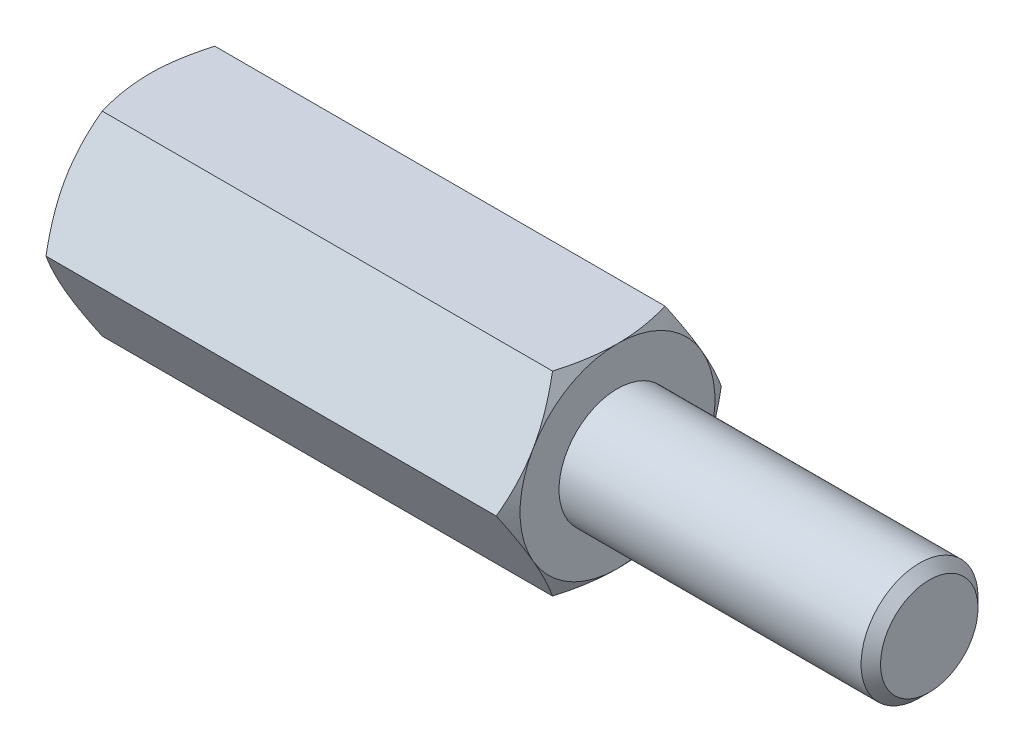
from build123d import *

# Parameters (mm, degrees)
EXTRUDE2_DEPTH = 6
SKETCH3_R      = 1.25
EXTRUDE3_DEPTH = 8
SKETCH5_R      = 1.5
EXTRUDE4_DEPTH = 8
CHAMFER1_SIZE  = 0.25


with BuildPart() as part:
    # Sketch1 → Extrude2 (new, symmetric)
    with BuildSketch(Plane(origin=(0, 0, 0), x_dir=(0, 0, -1), z_dir=(1, 0, 0))):
        Polygon((1.443375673, 2.5), (-1.443375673, 2.5), (-2.886751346, 0), (-1.443375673, -2.5), (1.443375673, -2.5), (2.886751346, 0), align=None)
    extrude(amount=EXTRUDE2_DEPTH, both=True)

    # Sketch2 → Cut-Revolve1 (revolve, cut)
    with BuildSketch(Plane.XY):
        with BuildLine():
            Line((-6, 2.5), (-4.5, 5.098076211))
            ThreePointArc((-4.5, 5.098076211), (-4.98810136, 6.276457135), (-6, 5.5))
            Line((-6, 5.5), (-6, 2.5))
        make_face()
    cut_revolve1 = revolve(axis=Axis((0, 0, 0), (1, 0, 0)), mode=Mode.SUBTRACT)

    # Mirror1: Cut-Revolve1 across plane
    add(cut_revolve1.mirror(Plane(origin=(0, 0, 0), x_dir=(0, 0, 1), z_dir=(1, 0, 0))), mode=Mode.SUBTRACT)

    # Sketch3 → Extrude3 (cut)
    with BuildSketch(Plane.ZY.offset(6)):
        Circle(SKETCH3_R)
    extrude(amount=-EXTRUDE3_DEPTH, mode=Mode.SUBTRACT)

    # Sketch4 → Cut-Revolve2 (revolve, cut)
    with BuildSketch(Plane.XY, mode=Mode.PRIVATE) as cut_revolve2_sk:
        Polygon((2, 0), (2, 1.25), (2.721687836, 0), align=None)
    revolve(cut_revolve2_sk.sketch.rotate(Axis((2.721687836, 0, 0), (-1, 0, 0)), 270), axis=Axis((2.721687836, 0, 0), (-1, 0, 0)), mode=Mode.SUBTRACT)

    # Sketch5 → Extrude4 (add)
    with BuildSketch(Plane(origin=(6, 0, 0), x_dir=(0, 0, -1), z_dir=(1, 0, 0))):
        Circle(SKETCH5_R)
    extrude(amount=EXTRUDE4_DEPTH)

    # Chamfer1
    chamfer1_edges = [part.edges().sort_by_distance(p)[0] for p in [
        (14, 0, 1.5),
    ]]
    chamfer(chamfer1_edges, length=CHAMFER1_SIZE)


solid = part.part
